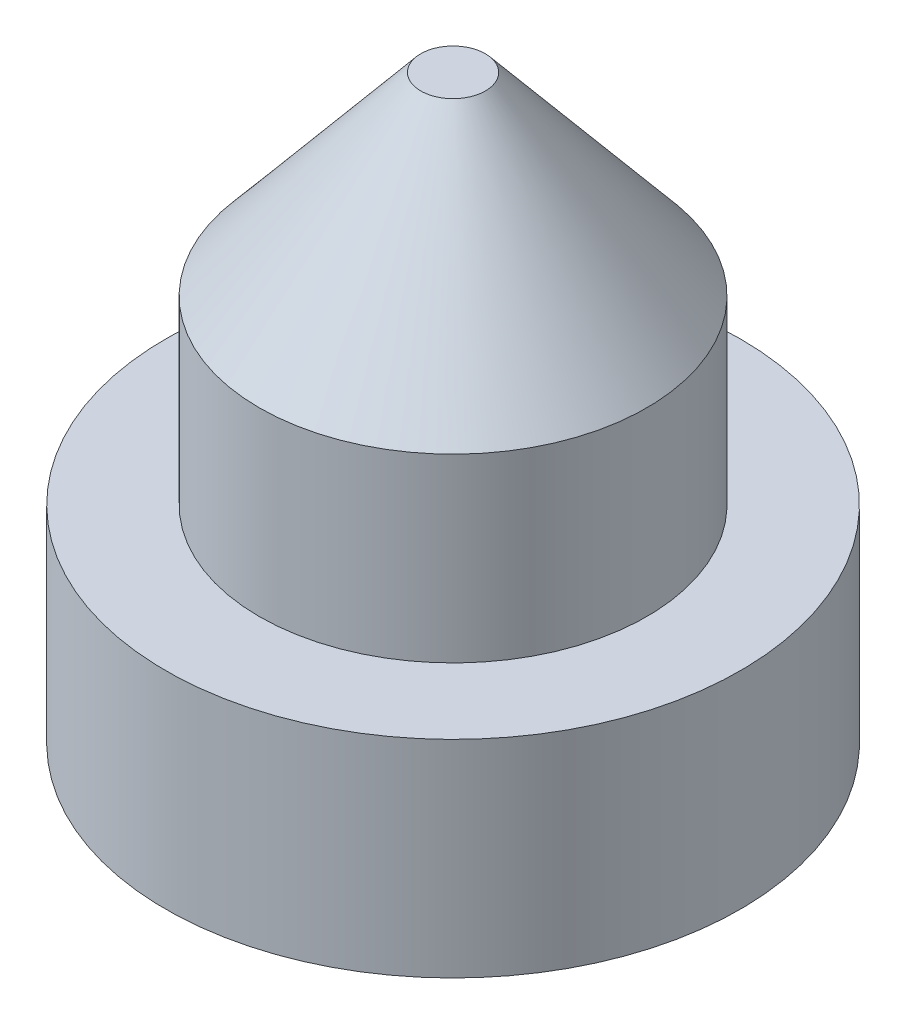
from build123d import *


with BuildPart() as part:
    # Esquisse1 → R_volution1 (revolve)
    with BuildSketch(Plane.XY, mode=Mode.PRIVATE) as r_volution1_sk:
        Polygon((2.225, 0), (2.225, 1.6), (1.5, 1.6), (1.5, 3), (0.25, 4.5), (0, 4.5), (0, 0), align=None)
    revolve(r_volution1_sk.sketch.rotate(Axis((0, 0, 0), (0, 1, 0)), 90), axis=Axis((0, 0, 0), (0, 1, 0)))


solid = part.part
